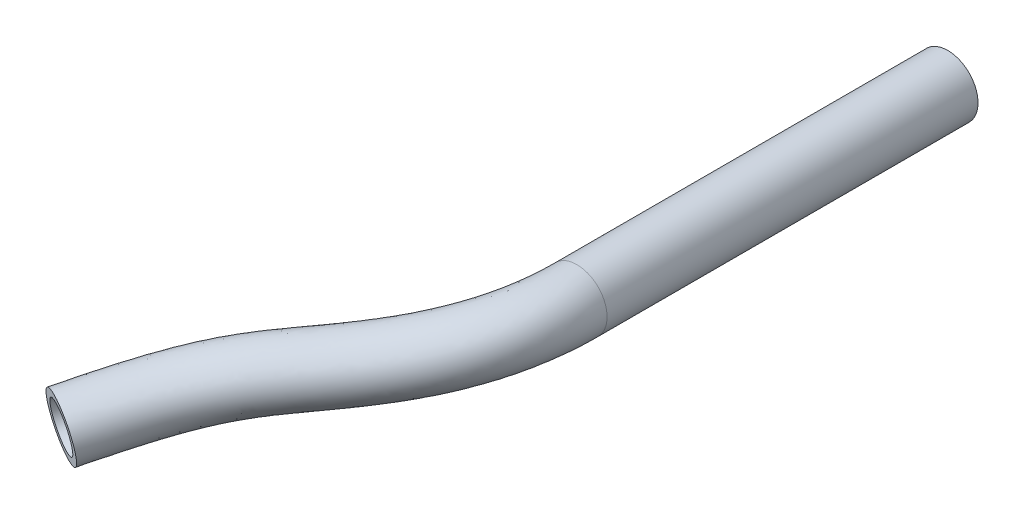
ISO-10303-21;
HEADER;
FILE_DESCRIPTION(('STEP AP214'),'2;1');
FILE_NAME('part.step','',(''),(''),'','','');
FILE_SCHEMA(('AUTOMOTIVE_DESIGN { 1 0 10303 214 1 1 1 1 }'));
ENDSEC;
DATA;
#1=APPLICATION_CONTEXT('core data for automotive mechanical design processes');
#2=APPLICATION_PROTOCOL_DEFINITION('international standard','automotive_design',2000,#1);
#3=PRODUCT_CONTEXT('',#1,'mechanical');
#4=PRODUCT('Part','Part','',(#3));
#5=PRODUCT_RELATED_PRODUCT_CATEGORY('part','',(#4));
#6=PRODUCT_DEFINITION_FORMATION('','',#4);
#7=PRODUCT_DEFINITION_CONTEXT('part definition',#1,'design');
#8=PRODUCT_DEFINITION('design','',#6,#7);
#9=PRODUCT_DEFINITION_SHAPE('','',#8);
#10=(LENGTH_UNIT() NAMED_UNIT(*) SI_UNIT(.MILLI.,.METRE.));
#11=(NAMED_UNIT(*) PLANE_ANGLE_UNIT() SI_UNIT($,.RADIAN.));
#12=(NAMED_UNIT(*) SI_UNIT($,.STERADIAN.) SOLID_ANGLE_UNIT());
#13=UNCERTAINTY_MEASURE_WITH_UNIT(LENGTH_MEASURE(1.E-05),#10,'distance_accuracy_value','');
#14=(GEOMETRIC_REPRESENTATION_CONTEXT(3) GLOBAL_UNCERTAINTY_ASSIGNED_CONTEXT((#13)) GLOBAL_UNIT_ASSIGNED_CONTEXT((#10,
#11,#12)) REPRESENTATION_CONTEXT('',''));
#15=CARTESIAN_POINT('',(0.,0.,0.));
#16=DIRECTION('',(0.,0.,1.));
#17=DIRECTION('',(1.,0.,0.));
#18=AXIS2_PLACEMENT_3D('',#15,#16,#17);
#19=CARTESIAN_POINT('',(0.,-13.4074772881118,3.23903712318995));
#20=DIRECTION('',(0.,0.,-1.));
#21=DIRECTION('',(0.,1.,0.));
#22=AXIS2_PLACEMENT_3D('',#19,#20,#21);
#23=CYLINDRICAL_SURFACE('',#22,1.5);
#24=CARTESIAN_POINT('',(0.,-13.4074772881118,3.23903712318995));
#25=DIRECTION('',(0.,0.,-1.));
#26=DIRECTION('',(-1.,0.,0.));
#27=AXIS2_PLACEMENT_3D('',#24,#25,#26);
#28=CIRCLE('',#27,1.5);
#29=CARTESIAN_POINT('',(0.,-11.9074772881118,3.23903712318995));
#30=VERTEX_POINT('',#29);
#31=EDGE_CURVE('E11',#30,#30,#28,.T.);
#32=CARTESIAN_POINT('',(0.,-13.4074772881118,-21.3340938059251));
#33=DIRECTION('',(0.,0.,-1.));
#34=DIRECTION('',(-1.,0.,0.));
#35=AXIS2_PLACEMENT_3D('',#32,#33,#34);
#36=CIRCLE('',#35,1.5);
#37=CARTESIAN_POINT('',(0.,-11.9074772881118,-21.3340938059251));
#38=VERTEX_POINT('',#37);
#39=EDGE_CURVE('E84',#38,#38,#36,.T.);
#40=CARTESIAN_POINT('',(0.,-11.9074772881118,3.23903712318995));
#41=CARTESIAN_POINT('',(0.,-11.9074772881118,2.983067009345));
#42=CARTESIAN_POINT('',(0.,-11.9074772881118,2.72709689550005));
#43=CARTESIAN_POINT('',(0.,-11.9074772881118,2.21515666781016));
#44=CARTESIAN_POINT('',(0.,-11.9074772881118,1.95918655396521));
#45=CARTESIAN_POINT('',(0.,-11.9074772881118,1.44724632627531));
#46=CARTESIAN_POINT('',(0.,-11.9074772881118,1.19127621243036));
#47=CARTESIAN_POINT('',(0.,-11.9074772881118,0.679335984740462));
#48=CARTESIAN_POINT('',(0.,-11.9074772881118,0.423365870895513));
#49=CARTESIAN_POINT('',(0.,-11.9074772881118,-0.0885743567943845));
#50=CARTESIAN_POINT('',(0.,-11.9074772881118,-0.344544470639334));
#51=CARTESIAN_POINT('',(0.,-11.9074772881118,-0.856484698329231));
#52=CARTESIAN_POINT('',(0.,-11.9074772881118,-1.11245481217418));
#53=CARTESIAN_POINT('',(0.,-11.9074772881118,-1.62439503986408));
#54=CARTESIAN_POINT('',(0.,-11.9074772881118,-1.88036515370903));
#55=CARTESIAN_POINT('',(0.,-11.9074772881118,-2.39230538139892));
#56=CARTESIAN_POINT('',(0.,-11.9074772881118,-2.64827549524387));
#57=CARTESIAN_POINT('',(0.,-11.9074772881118,-3.16021572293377));
#58=CARTESIAN_POINT('',(0.,-11.9074772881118,-3.41618583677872));
#59=CARTESIAN_POINT('',(0.,-11.9074772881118,-3.92812606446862));
#60=CARTESIAN_POINT('',(0.,-11.9074772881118,-4.18409617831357));
#61=CARTESIAN_POINT('',(0.,-11.9074772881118,-4.69603640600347));
#62=CARTESIAN_POINT('',(0.,-11.9074772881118,-4.95200651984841));
#63=CARTESIAN_POINT('',(0.,-11.9074772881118,-5.46394674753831));
#64=CARTESIAN_POINT('',(0.,-11.9074772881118,-5.71991686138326));
#65=CARTESIAN_POINT('',(0.,-11.9074772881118,-6.23185708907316));
#66=CARTESIAN_POINT('',(0.,-11.9074772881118,-6.48782720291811));
#67=CARTESIAN_POINT('',(0.,-11.9074772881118,-6.99976743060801));
#68=CARTESIAN_POINT('',(0.,-11.9074772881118,-7.25573754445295));
#69=CARTESIAN_POINT('',(0.,-11.9074772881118,-7.76767777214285));
#70=CARTESIAN_POINT('',(0.,-11.9074772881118,-8.0236478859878));
#71=CARTESIAN_POINT('',(0.,-11.9074772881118,-8.5355881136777));
#72=CARTESIAN_POINT('',(0.,-11.9074772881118,-8.79155822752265));
#73=CARTESIAN_POINT('',(0.,-11.9074772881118,-9.30349845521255));
#74=CARTESIAN_POINT('',(0.,-11.9074772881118,-9.5594685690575));
#75=CARTESIAN_POINT('',(0.,-11.9074772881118,-10.0714087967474));
#76=CARTESIAN_POINT('',(0.,-11.9074772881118,-10.3273789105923));
#77=CARTESIAN_POINT('',(0.,-11.9074772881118,-10.8393191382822));
#78=CARTESIAN_POINT('',(0.,-11.9074772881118,-11.0952892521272));
#79=CARTESIAN_POINT('',(0.,-11.9074772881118,-11.6072294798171));
#80=CARTESIAN_POINT('',(0.,-11.9074772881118,-11.863199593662));
#81=CARTESIAN_POINT('',(0.,-11.9074772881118,-12.3751398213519));
#82=CARTESIAN_POINT('',(0.,-11.9074772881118,-12.6311099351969));
#83=CARTESIAN_POINT('',(0.,-11.9074772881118,-13.1430501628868));
#84=CARTESIAN_POINT('',(0.,-11.9074772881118,-13.3990202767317));
#85=CARTESIAN_POINT('',(0.,-11.9074772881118,-13.9109605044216));
#86=CARTESIAN_POINT('',(0.,-11.9074772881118,-14.1669306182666));
#87=CARTESIAN_POINT('',(0.,-11.9074772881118,-14.6788708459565));
#88=CARTESIAN_POINT('',(0.,-11.9074772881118,-14.9348409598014));
#89=CARTESIAN_POINT('',(0.,-11.9074772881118,-15.4467811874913));
#90=CARTESIAN_POINT('',(0.,-11.9074772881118,-15.7027513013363));
#91=CARTESIAN_POINT('',(0.,-11.9074772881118,-16.2146915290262));
#92=CARTESIAN_POINT('',(0.,-11.9074772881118,-16.4706616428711));
#93=CARTESIAN_POINT('',(0.,-11.9074772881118,-16.982601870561));
#94=CARTESIAN_POINT('',(0.,-11.9074772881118,-17.238571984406));
#95=CARTESIAN_POINT('',(0.,-11.9074772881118,-17.7505122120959));
#96=CARTESIAN_POINT('',(0.,-11.9074772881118,-18.0064823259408));
#97=CARTESIAN_POINT('',(0.,-11.9074772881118,-18.5184225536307));
#98=CARTESIAN_POINT('',(0.,-11.9074772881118,-18.7743926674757));
#99=CARTESIAN_POINT('',(0.,-11.9074772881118,-19.2863328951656));
#100=CARTESIAN_POINT('',(0.,-11.9074772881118,-19.5423030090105));
#101=CARTESIAN_POINT('',(0.,-11.9074772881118,-20.0542432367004));
#102=CARTESIAN_POINT('',(0.,-11.9074772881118,-20.3102133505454));
#103=CARTESIAN_POINT('',(0.,-11.9074772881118,-20.8221535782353));
#104=CARTESIAN_POINT('',(0.,-11.9074772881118,-21.0781236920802));
#105=CARTESIAN_POINT('',(0.,-11.9074772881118,-21.3340938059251));
#106=B_SPLINE_CURVE_WITH_KNOTS('',3,(#40,#41,#42,#43,#44,#45,#46,#47,#48,#49,#50,#51,#52,#53,
#54,#55,#56,#57,#58,#59,#60,#61,#62,#63,#64,#65,#66,#67,#68,#69,#70,#71,#72,#73,#74,#75,#76,#77,
#78,#79,#80,#81,#82,#83,#84,#85,#86,#87,#88,#89,#90,#91,#92,#93,#94,#95,#96,#97,#98,#99,#100,
#101,#102,#103,#104,#105),.UNSPECIFIED.,.F.,.F.,(4,2,2,2,2,2,2,2,2,2,2,2,2,2,2,2,2,2,2,2,2,2,2,
2,2,2,2,2,2,2,2,2,4),(0.,0.767910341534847,1.53582068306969,2.30373102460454,3.07164136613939,
3.83955170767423,4.60746204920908,5.37537239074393,6.14328273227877,6.91119307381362,
7.67910341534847,8.44701375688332,9.21492409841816,9.98283443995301,10.7507447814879,
11.5186551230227,12.2865654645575,13.0544758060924,13.8223861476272,14.5902964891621,
15.3582068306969,16.1261171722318,16.8940275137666,17.6619378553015,18.4298481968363,
19.1977585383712,19.965668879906,20.7335792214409,21.5014895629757,22.2693999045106,
23.0373102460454,23.8052205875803,24.5731309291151),.UNSPECIFIED.);
#107=EDGE_CURVE('BSEAM73',#30,#38,#106,.T.);
#108=ORIENTED_EDGE('',*,*,#31,.F.);
#109=ORIENTED_EDGE('',*,*,#39,.T.);
#110=ORIENTED_EDGE('',*,*,#107,.T.);
#111=ORIENTED_EDGE('',*,*,#107,.F.);
#112=EDGE_LOOP('',(#108,#110,#109,#111));
#113=FACE_BOUND('',#112,.T.);
#114=ADVANCED_FACE('F73',(#113),#23,.F.);
#115=CARTESIAN_POINT('',(0.,-13.4074772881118,3.23903712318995));
#116=DIRECTION('',(0.,0.,-1.));
#117=DIRECTION('',(0.,1.,0.));
#118=AXIS2_PLACEMENT_3D('',#115,#116,#117);
#119=CYLINDRICAL_SURFACE('',#118,2.);
#120=CARTESIAN_POINT('',(0.,-13.4074772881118,3.23903712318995));
#121=DIRECTION('',(0.,0.,-1.));
#122=DIRECTION('',(-1.,0.,0.));
#123=AXIS2_PLACEMENT_3D('',#120,#121,#122);
#124=CIRCLE('',#123,2.);
#125=CARTESIAN_POINT('',(0.,-11.4074772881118,3.23903712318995));
#126=VERTEX_POINT('',#125);
#127=EDGE_CURVE('E89',#126,#126,#124,.T.);
#128=CARTESIAN_POINT('',(0.,-13.4074772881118,-21.3340938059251));
#129=DIRECTION('',(0.,0.,-1.));
#130=DIRECTION('',(-1.,0.,0.));
#131=AXIS2_PLACEMENT_3D('',#128,#129,#130);
#132=CIRCLE('',#131,2.);
#133=CARTESIAN_POINT('',(0.,-11.4074772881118,-21.3340938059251));
#134=VERTEX_POINT('',#133);
#135=EDGE_CURVE('E76',#134,#134,#132,.T.);
#136=CARTESIAN_POINT('',(0.,-11.4074772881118,3.23903712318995));
#137=CARTESIAN_POINT('',(0.,-11.4074772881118,2.983067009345));
#138=CARTESIAN_POINT('',(0.,-11.4074772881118,2.72709689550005));
#139=CARTESIAN_POINT('',(0.,-11.4074772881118,2.21515666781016));
#140=CARTESIAN_POINT('',(0.,-11.4074772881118,1.95918655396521));
#141=CARTESIAN_POINT('',(0.,-11.4074772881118,1.44724632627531));
#142=CARTESIAN_POINT('',(0.,-11.4074772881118,1.19127621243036));
#143=CARTESIAN_POINT('',(0.,-11.4074772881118,0.679335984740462));
#144=CARTESIAN_POINT('',(0.,-11.4074772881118,0.423365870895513));
#145=CARTESIAN_POINT('',(0.,-11.4074772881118,-0.0885743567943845));
#146=CARTESIAN_POINT('',(0.,-11.4074772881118,-0.344544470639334));
#147=CARTESIAN_POINT('',(0.,-11.4074772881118,-0.856484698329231));
#148=CARTESIAN_POINT('',(0.,-11.4074772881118,-1.11245481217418));
#149=CARTESIAN_POINT('',(0.,-11.4074772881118,-1.62439503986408));
#150=CARTESIAN_POINT('',(0.,-11.4074772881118,-1.88036515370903));
#151=CARTESIAN_POINT('',(0.,-11.4074772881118,-2.39230538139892));
#152=CARTESIAN_POINT('',(0.,-11.4074772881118,-2.64827549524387));
#153=CARTESIAN_POINT('',(0.,-11.4074772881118,-3.16021572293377));
#154=CARTESIAN_POINT('',(0.,-11.4074772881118,-3.41618583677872));
#155=CARTESIAN_POINT('',(0.,-11.4074772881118,-3.92812606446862));
#156=CARTESIAN_POINT('',(0.,-11.4074772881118,-4.18409617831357));
#157=CARTESIAN_POINT('',(0.,-11.4074772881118,-4.69603640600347));
#158=CARTESIAN_POINT('',(0.,-11.4074772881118,-4.95200651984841));
#159=CARTESIAN_POINT('',(0.,-11.4074772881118,-5.46394674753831));
#160=CARTESIAN_POINT('',(0.,-11.4074772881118,-5.71991686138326));
#161=CARTESIAN_POINT('',(0.,-11.4074772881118,-6.23185708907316));
#162=CARTESIAN_POINT('',(0.,-11.4074772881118,-6.48782720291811));
#163=CARTESIAN_POINT('',(0.,-11.4074772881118,-6.99976743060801));
#164=CARTESIAN_POINT('',(0.,-11.4074772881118,-7.25573754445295));
#165=CARTESIAN_POINT('',(0.,-11.4074772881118,-7.76767777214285));
#166=CARTESIAN_POINT('',(0.,-11.4074772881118,-8.0236478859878));
#167=CARTESIAN_POINT('',(0.,-11.4074772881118,-8.5355881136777));
#168=CARTESIAN_POINT('',(0.,-11.4074772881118,-8.79155822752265));
#169=CARTESIAN_POINT('',(0.,-11.4074772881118,-9.30349845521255));
#170=CARTESIAN_POINT('',(0.,-11.4074772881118,-9.5594685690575));
#171=CARTESIAN_POINT('',(0.,-11.4074772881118,-10.0714087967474));
#172=CARTESIAN_POINT('',(0.,-11.4074772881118,-10.3273789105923));
#173=CARTESIAN_POINT('',(0.,-11.4074772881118,-10.8393191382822));
#174=CARTESIAN_POINT('',(0.,-11.4074772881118,-11.0952892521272));
#175=CARTESIAN_POINT('',(0.,-11.4074772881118,-11.6072294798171));
#176=CARTESIAN_POINT('',(0.,-11.4074772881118,-11.863199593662));
#177=CARTESIAN_POINT('',(0.,-11.4074772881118,-12.3751398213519));
#178=CARTESIAN_POINT('',(0.,-11.4074772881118,-12.6311099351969));
#179=CARTESIAN_POINT('',(0.,-11.4074772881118,-13.1430501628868));
#180=CARTESIAN_POINT('',(0.,-11.4074772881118,-13.3990202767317));
#181=CARTESIAN_POINT('',(0.,-11.4074772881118,-13.9109605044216));
#182=CARTESIAN_POINT('',(0.,-11.4074772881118,-14.1669306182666));
#183=CARTESIAN_POINT('',(0.,-11.4074772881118,-14.6788708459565));
#184=CARTESIAN_POINT('',(0.,-11.4074772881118,-14.9348409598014));
#185=CARTESIAN_POINT('',(0.,-11.4074772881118,-15.4467811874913));
#186=CARTESIAN_POINT('',(0.,-11.4074772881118,-15.7027513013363));
#187=CARTESIAN_POINT('',(0.,-11.4074772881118,-16.2146915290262));
#188=CARTESIAN_POINT('',(0.,-11.4074772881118,-16.4706616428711));
#189=CARTESIAN_POINT('',(0.,-11.4074772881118,-16.982601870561));
#190=CARTESIAN_POINT('',(0.,-11.4074772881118,-17.238571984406));
#191=CARTESIAN_POINT('',(0.,-11.4074772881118,-17.7505122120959));
#192=CARTESIAN_POINT('',(0.,-11.4074772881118,-18.0064823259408));
#193=CARTESIAN_POINT('',(0.,-11.4074772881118,-18.5184225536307));
#194=CARTESIAN_POINT('',(0.,-11.4074772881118,-18.7743926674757));
#195=CARTESIAN_POINT('',(0.,-11.4074772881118,-19.2863328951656));
#196=CARTESIAN_POINT('',(0.,-11.4074772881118,-19.5423030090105));
#197=CARTESIAN_POINT('',(0.,-11.4074772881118,-20.0542432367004));
#198=CARTESIAN_POINT('',(0.,-11.4074772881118,-20.3102133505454));
#199=CARTESIAN_POINT('',(0.,-11.4074772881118,-20.8221535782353));
#200=CARTESIAN_POINT('',(0.,-11.4074772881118,-21.0781236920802));
#201=CARTESIAN_POINT('',(0.,-11.4074772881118,-21.3340938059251));
#202=B_SPLINE_CURVE_WITH_KNOTS('',3,(#136,#137,#138,#139,#140,#141,#142,#143,#144,#145,#146,
#147,#148,#149,#150,#151,#152,#153,#154,#155,#156,#157,#158,#159,#160,#161,#162,#163,#164,#165,
#166,#167,#168,#169,#170,#171,#172,#173,#174,#175,#176,#177,#178,#179,#180,#181,#182,#183,#184,
#185,#186,#187,#188,#189,#190,#191,#192,#193,#194,#195,#196,#197,#198,#199,#200,#201),
.UNSPECIFIED.,.F.,.F.,(4,2,2,2,2,2,2,2,2,2,2,2,2,2,2,2,2,2,2,2,2,2,2,2,2,2,2,2,2,2,2,2,4),(0.,
0.767910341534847,1.53582068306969,2.30373102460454,3.07164136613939,3.83955170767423,
4.60746204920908,5.37537239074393,6.14328273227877,6.91119307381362,7.67910341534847,
8.44701375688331,9.21492409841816,9.98283443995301,10.7507447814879,11.5186551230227,
12.2865654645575,13.0544758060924,13.8223861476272,14.5902964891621,15.3582068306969,
16.1261171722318,16.8940275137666,17.6619378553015,18.4298481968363,19.1977585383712,
19.965668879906,20.7335792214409,21.5014895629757,22.2693999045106,23.0373102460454,
23.8052205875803,24.5731309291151),.UNSPECIFIED.);
#203=EDGE_CURVE('BSEAM117',#126,#134,#202,.T.);
#204=ORIENTED_EDGE('',*,*,#127,.T.);
#205=ORIENTED_EDGE('',*,*,#135,.F.);
#206=ORIENTED_EDGE('',*,*,#203,.T.);
#207=ORIENTED_EDGE('',*,*,#203,.F.);
#208=EDGE_LOOP('',(#204,#206,#205,#207));
#209=FACE_BOUND('',#208,.T.);
#210=ADVANCED_FACE('F117',(#209),#119,.T.);
#211=CARTESIAN_POINT('',(0.,-13.4074772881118,-21.3340938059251));
#212=DIRECTION('',(0.,0.,-1.));
#213=DIRECTION('',(-1.,0.,0.));
#214=AXIS2_PLACEMENT_3D('',#211,#212,#213);
#215=PLANE('',#214);
#216=ORIENTED_EDGE('',*,*,#39,.F.);
#217=EDGE_LOOP('',(#216));
#218=FACE_BOUND('',#217,.T.);
#219=ORIENTED_EDGE('',*,*,#135,.T.);
#220=EDGE_LOOP('',(#219));
#221=FACE_BOUND('',#220,.T.);
#222=ADVANCED_FACE('F122',(#218,#221),#215,.T.);
#223=CARTESIAN_POINT('',(-16.5820748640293,-20.2456852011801,20.8132033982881));
#224=DIRECTION('',(0.441299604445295,0.181985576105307,-0.878712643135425));
#225=DIRECTION('',(-0.896341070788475,0.042747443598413,-0.441299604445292));
#226=AXIS2_PLACEMENT_3D('',#223,#224,#225);
#227=PLANE('',#226);
#228=CARTESIAN_POINT('',(-16.5820748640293,-20.2456852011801,20.8132033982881));
#229=DIRECTION('',(0.441299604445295,0.181985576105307,-0.878712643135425));
#230=DIRECTION('',(-0.896341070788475,0.042747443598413,-0.441299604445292));
#231=AXIS2_PLACEMENT_3D('',#228,#229,#230);
#232=CIRCLE('',#231,1.5);
#233=CARTESIAN_POINT('',(-17.926586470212,-20.1815640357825,20.1512539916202));
#234=VERTEX_POINT('',#233);
#235=EDGE_CURVE('E97',#234,#234,#232,.T.);
#236=ORIENTED_EDGE('',*,*,#235,.T.);
#237=EDGE_LOOP('',(#236));
#238=FACE_BOUND('',#237,.T.);
#239=CARTESIAN_POINT('',(-16.5820748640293,-20.2456852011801,20.8132033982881));
#240=DIRECTION('',(0.441299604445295,0.181985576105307,-0.878712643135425));
#241=DIRECTION('',(-0.896341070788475,0.042747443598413,-0.441299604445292));
#242=AXIS2_PLACEMENT_3D('',#239,#240,#241);
#243=CIRCLE('',#242,2.);
#244=CARTESIAN_POINT('',(-18.3747570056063,-20.1601903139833,19.9306041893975));
#245=VERTEX_POINT('',#244);
#246=EDGE_CURVE('E86',#245,#245,#243,.T.);
#247=ORIENTED_EDGE('',*,*,#246,.F.);
#248=EDGE_LOOP('',(#247));
#249=FACE_BOUND('',#248,.T.);
#250=ADVANCED_FACE('F101',(#238,#249),#227,.F.);
#251=CARTESIAN_POINT('',(-2.,-13.4074772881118,3.23903712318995));
#252=CARTESIAN_POINT('',(-1.99777758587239,-13.4065607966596,3.88939531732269));
#253=CARTESIAN_POINT('',(-2.08495535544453,-13.4425116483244,4.68277189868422));
#254=CARTESIAN_POINT('',(-2.42323183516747,-13.5820119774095,5.9199205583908));
#255=CARTESIAN_POINT('',(-2.93202442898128,-13.7918306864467,6.88450417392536));
#256=CARTESIAN_POINT('',(-3.60254837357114,-14.0683450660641,7.74480923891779));
#257=CARTESIAN_POINT('',(-4.83549142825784,-14.5767929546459,8.87497938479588));
#258=CARTESIAN_POINT('',(-6.5631333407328,-15.2892474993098,9.84791785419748));
#259=CARTESIAN_POINT('',(-8.35655553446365,-16.028828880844,10.5935749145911));
#260=CARTESIAN_POINT('',(-9.86167932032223,-16.6495201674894,11.1933071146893));
#261=CARTESIAN_POINT('',(-11.4249770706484,-17.2942015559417,11.8383091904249));
#262=CARTESIAN_POINT('',(-13.2534682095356,-18.0482448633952,12.8824099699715));
#263=CARTESIAN_POINT('',(-15.002693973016,-18.769600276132,14.4673752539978));
#264=CARTESIAN_POINT('',(-16.6358741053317,-19.4431001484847,16.6669708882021));
#265=CARTESIAN_POINT('',(-17.7968450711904,-19.9218677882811,18.7696598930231));
#266=CARTESIAN_POINT('',(-18.3747570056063,-20.1601903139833,19.9306041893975));
#267=CARTESIAN_POINT('',(-2.,-17.4074772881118,3.23903712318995));
#268=CARTESIAN_POINT('',(-1.99653572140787,-17.4060486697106,4.25280946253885));
#269=CARTESIAN_POINT('',(-2.06913626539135,-17.4359880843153,4.17379525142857));
#270=CARTESIAN_POINT('',(-2.3170581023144,-17.538227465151,5.36645587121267));
#271=CARTESIAN_POINT('',(-2.68058992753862,-17.6881427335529,5.98290002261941));
#272=CARTESIAN_POINT('',(-3.18224013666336,-17.8950160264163,6.65277796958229));
#273=CARTESIAN_POINT('',(-4.1737381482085,-18.3038954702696,7.56203828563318));
#274=CARTESIAN_POINT('',(-5.71031105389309,-18.9375559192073,8.44599815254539));
#275=CARTESIAN_POINT('',(-7.43167259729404,-19.6474205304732,9.1613261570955));
#276=CARTESIAN_POINT('',(-8.93337669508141,-20.2667015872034,9.76024048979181));
#277=CARTESIAN_POINT('',(-10.5697963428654,-20.9415373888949,10.4335756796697));
#278=CARTESIAN_POINT('',(-12.6257886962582,-21.7893989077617,11.5944175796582));
#279=CARTESIAN_POINT('',(-14.6344082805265,-22.6177245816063,13.4345567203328));
#280=CARTESIAN_POINT('',(-16.3513519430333,-23.3257673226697,15.7176255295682));
#281=CARTESIAN_POINT('',(-17.7113007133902,-23.8865905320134,18.2133654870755));
#282=CARTESIAN_POINT('',(-18.2037672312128,-24.0896766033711,19.2026618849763));
#283=CARTESIAN_POINT('',(2.,-17.4074772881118,3.23903712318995));
#284=CARTESIAN_POINT('',(2.00346427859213,-17.4060486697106,4.25280946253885));
#285=CARTESIAN_POINT('',(1.89110625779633,-17.4523834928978,4.99903650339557));
#286=CARTESIAN_POINT('',(1.42585379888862,-17.6442468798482,6.8181320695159));
#287=CARTESIAN_POINT('',(0.709603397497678,-17.9396181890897,8.13991282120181));
#288=CARTESIAN_POINT('',(-0.201428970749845,-18.315314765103,9.30849360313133));
#289=CARTESIAN_POINT('',(-1.77843453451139,-18.9656490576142,10.7401504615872));
#290=CARTESIAN_POINT('',(-3.77848495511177,-19.790440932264,11.8465731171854));
#291=CARTESIAN_POINT('',(-5.67415664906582,-20.5721885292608,12.6344896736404));
#292=CARTESIAN_POINT('',(-7.18436179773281,-21.1949752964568,13.2348575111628));
#293=CARTESIAN_POINT('',(-8.6453722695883,-21.7974748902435,13.8437256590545));
#294=CARTESIAN_POINT('',(-10.1409582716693,-22.4142329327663,14.703800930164));
#295=CARTESIAN_POINT('',(-11.5532350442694,-22.9966354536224,15.9908202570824));
#296=CARTESIAN_POINT('',(-12.9451335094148,-23.570634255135,17.8265323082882));
#297=CARTESIAN_POINT('',(-14.1259364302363,-24.057580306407,19.9785639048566));
#298=CARTESIAN_POINT('',(-14.6184029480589,-24.2606663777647,20.9678603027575));
#299=CARTESIAN_POINT('',(2.,-13.4074772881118,3.23903712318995));
#300=CARTESIAN_POINT('',(2.00284334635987,-13.4063047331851,4.07110238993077));
#301=CARTESIAN_POINT('',(1.87499900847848,-13.4590258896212,5.42368360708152));
#302=CARTESIAN_POINT('',(1.3197572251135,-13.6879995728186,7.39418955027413));
#303=CARTESIAN_POINT('',(0.458148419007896,-14.0433145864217,9.03547534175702));
#304=CARTESIAN_POINT('',(-0.621732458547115,-14.4886418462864,10.4020986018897));
#305=CARTESIAN_POINT('',(-2.44018796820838,-15.2385466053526,12.0519247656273));
#306=CARTESIAN_POINT('',(-4.63133860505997,-16.142145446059,13.2487069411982));
#307=CARTESIAN_POINT('',(-6.59898211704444,-16.9535731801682,14.0667552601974));
#308=CARTESIAN_POINT('',(-8.11264996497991,-17.5777879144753,14.6678317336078));
#309=CARTESIAN_POINT('',(-9.50093138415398,-18.1502950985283,15.2492406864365));
#310=CARTESIAN_POINT('',(-10.7672150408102,-18.6724921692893,15.9889294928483));
#311=CARTESIAN_POINT('',(-11.9268333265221,-19.1507019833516,17.0343125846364));
#312=CARTESIAN_POINT('',(-13.2098280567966,-19.6797904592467,18.7360463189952));
#313=CARTESIAN_POINT('',(-14.2542034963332,-20.110475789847,20.6206822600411));
#314=CARTESIAN_POINT('',(-14.7893927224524,-20.3311800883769,21.6958026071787));
#315=CARTESIAN_POINT('',(2.,-9.40747728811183,3.23903712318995));
#316=CARTESIAN_POINT('',(2.00222241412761,-9.40656079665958,3.8893953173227));
#317=CARTESIAN_POINT('',(1.85889175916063,-9.46566828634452,5.84833071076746));
#318=CARTESIAN_POINT('',(1.21366065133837,-9.73175226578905,7.97024703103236));
#319=CARTESIAN_POINT('',(0.206693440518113,-10.1470109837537,9.93103786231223));
#320=CARTESIAN_POINT('',(-1.04203594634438,-10.6619689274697,11.4957036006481));
#321=CARTESIAN_POINT('',(-3.10194140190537,-11.5114441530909,13.3636990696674));
#322=CARTESIAN_POINT('',(-5.48419225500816,-12.4938499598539,14.650840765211));
#323=CARTESIAN_POINT('',(-7.52380758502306,-13.3349578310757,15.4990208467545));
#324=CARTESIAN_POINT('',(-9.04093813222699,-13.9606005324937,16.1008059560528));
#325=CARTESIAN_POINT('',(-10.3564904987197,-14.5031153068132,16.6547557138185));
#326=CARTESIAN_POINT('',(-11.3934718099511,-14.9307514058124,17.2740580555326));
#327=CARTESIAN_POINT('',(-12.3004316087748,-15.3047685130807,18.0778049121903));
#328=CARTESIAN_POINT('',(-13.4745226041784,-15.7889466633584,19.6455603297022));
#329=CARTESIAN_POINT('',(-14.38247056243,-16.1633712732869,21.2628006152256));
#330=CARTESIAN_POINT('',(-14.9603824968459,-16.4016937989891,22.4237449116));
#331=CARTESIAN_POINT('',(-2.,-9.40747728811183,3.23903712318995));
#332=CARTESIAN_POINT('',(-1.99901945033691,-9.40707292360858,3.52598117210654));
#333=CARTESIAN_POINT('',(-2.10077444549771,-9.44903521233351,5.19174854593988));
#334=CARTESIAN_POINT('',(-2.52940556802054,-9.62579648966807,6.47338524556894));
#335=CARTESIAN_POINT('',(-3.18345893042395,-9.89551863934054,7.78610832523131));
#336=CARTESIAN_POINT('',(-4.02285661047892,-10.2416741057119,8.83684050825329));
#337=CARTESIAN_POINT('',(-5.4972447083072,-10.8496904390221,10.1879204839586));
#338=CARTESIAN_POINT('',(-7.4159556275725,-11.6409390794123,11.2498375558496));
#339=CARTESIAN_POINT('',(-9.28143847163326,-12.4102372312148,12.0258236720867));
#340=CARTESIAN_POINT('',(-10.789981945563,-13.0323387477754,12.6263737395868));
#341=CARTESIAN_POINT('',(-12.2801577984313,-13.6468657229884,13.2430427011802));
#342=CARTESIAN_POINT('',(-13.881147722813,-14.3070908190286,14.1704023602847));
#343=CARTESIAN_POINT('',(-15.3709796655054,-14.9214759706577,15.5001937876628));
#344=CARTESIAN_POINT('',(-16.9203962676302,-15.5604329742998,17.6163162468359));
#345=CARTESIAN_POINT('',(-17.8823894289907,-15.9571450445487,19.3259542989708));
#346=CARTESIAN_POINT('',(-18.5457467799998,-16.2307040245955,20.6585464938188));
#347=CARTESIAN_POINT('',(-2.,-13.4074772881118,3.23903712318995));
#348=CARTESIAN_POINT('',(-1.99777758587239,-13.4065607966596,3.88939531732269));
#349=CARTESIAN_POINT('',(-2.08495535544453,-13.4425116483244,4.68277189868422));
#350=CARTESIAN_POINT('',(-2.42323183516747,-13.5820119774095,5.9199205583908));
#351=CARTESIAN_POINT('',(-2.93202442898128,-13.7918306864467,6.88450417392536));
#352=CARTESIAN_POINT('',(-3.60254837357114,-14.0683450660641,7.74480923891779));
#353=CARTESIAN_POINT('',(-4.83549142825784,-14.5767929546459,8.87497938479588));
#354=CARTESIAN_POINT('',(-6.5631333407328,-15.2892474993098,9.84791785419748));
#355=CARTESIAN_POINT('',(-8.35655553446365,-16.028828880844,10.5935749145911));
#356=CARTESIAN_POINT('',(-9.86167932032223,-16.6495201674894,11.1933071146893));
#357=CARTESIAN_POINT('',(-11.4249770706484,-17.2942015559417,11.8383091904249));
#358=CARTESIAN_POINT('',(-13.2534682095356,-18.0482448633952,12.8824099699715));
#359=CARTESIAN_POINT('',(-15.002693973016,-18.769600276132,14.4673752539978));
#360=CARTESIAN_POINT('',(-16.6358741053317,-19.4431001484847,16.6669708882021));
#361=CARTESIAN_POINT('',(-17.7968450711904,-19.9218677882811,18.7696598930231));
#362=CARTESIAN_POINT('',(-18.3747570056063,-20.1601903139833,19.9306041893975));
#363=(BOUNDED_SURFACE() B_SPLINE_SURFACE(3,3,((#251,#252,#253,#254,#255,#256,#257,#258,#259,
#260,#261,#262,#263,#264,#265,#266),(#267,#268,#269,#270,#271,#272,#273,#274,#275,#276,#277,
#278,#279,#280,#281,#282),(#283,#284,#285,#286,#287,#288,#289,#290,#291,#292,#293,#294,#295,
#296,#297,#298),(#299,#300,#301,#302,#303,#304,#305,#306,#307,#308,#309,#310,#311,#312,#313,
#314),(#315,#316,#317,#318,#319,#320,#321,#322,#323,#324,#325,#326,#327,#328,#329,#330),(#331,
#332,#333,#334,#335,#336,#337,#338,#339,#340,#341,#342,#343,#344,#345,#346),(#347,#348,#349,
#350,#351,#352,#353,#354,#355,#356,#357,#358,#359,#360,#361,#362)),.UNSPECIFIED.,.T.,.F.,
.F.) B_SPLINE_SURFACE_WITH_KNOTS((4,3,4),(4,1,1,1,1,1,1,1,1,1,1,1,1,4),(0.,0.5,1.),(0.,
0.0499999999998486,0.1,0.15,0.2,0.25,0.375,0.448815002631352,0.5,0.59999999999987,0.7,
0.800000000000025,0.900000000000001,1.),
.UNSPECIFIED.) GEOMETRIC_REPRESENTATION_ITEM() RATIONAL_B_SPLINE_SURFACE(((1.,1.,1.,1.,1.,1.,1.,
1.,1.,1.,1.,1.,1.,1.,1.,1.),(0.333333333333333,0.333333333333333,0.333333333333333,
0.333333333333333,0.333333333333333,0.333333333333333,0.333333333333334,0.333333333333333,
0.333333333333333,0.333333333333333,0.333333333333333,0.333333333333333,0.333333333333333,
0.333333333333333,0.333333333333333,0.333333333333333),(0.333333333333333,0.333333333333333,
0.333333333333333,0.333333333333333,0.333333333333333,0.333333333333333,0.333333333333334,
0.333333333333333,0.333333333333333,0.333333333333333,0.333333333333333,0.333333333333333,
0.333333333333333,0.333333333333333,0.333333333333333,0.333333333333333),(1.,1.,1.,1.,1.,1.,1.,
1.,1.,1.,1.,1.,1.,1.,1.,1.),(0.333333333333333,0.333333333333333,0.333333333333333,
0.333333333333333,0.333333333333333,0.333333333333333,0.333333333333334,0.333333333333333,
0.333333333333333,0.333333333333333,0.333333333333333,0.333333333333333,0.333333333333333,
0.333333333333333,0.333333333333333,0.333333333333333),(0.333333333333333,0.333333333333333,
0.333333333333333,0.333333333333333,0.333333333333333,0.333333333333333,0.333333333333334,
0.333333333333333,0.333333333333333,0.333333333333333,0.333333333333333,0.333333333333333,
0.333333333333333,0.333333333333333,0.333333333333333,0.333333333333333),(1.,1.,1.,1.,1.,1.,1.,
1.,1.,1.,1.,1.,1.,1.,1.,1.))) REPRESENTATION_ITEM('') SURFACE());
#364=ORIENTED_EDGE('',*,*,#127,.F.);
#365=EDGE_LOOP('',(#364));
#366=FACE_BOUND('',#365,.T.);
#367=ORIENTED_EDGE('',*,*,#246,.T.);
#368=EDGE_LOOP('',(#367));
#369=FACE_BOUND('',#368,.T.);
#370=ADVANCED_FACE('F106',(#366,#369),#363,.T.);
#371=CARTESIAN_POINT('',(-1.5,-13.4074772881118,3.23903712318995));
#372=CARTESIAN_POINT('',(-1.49777758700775,-13.4065607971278,3.88939498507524));
#373=CARTESIAN_POINT('',(-1.58992503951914,-13.4445610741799,4.78592720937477));
#374=CARTESIAN_POINT('',(-1.9553678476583,-13.5952644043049,6.10138004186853));
#375=CARTESIAN_POINT('',(-2.50825026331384,-13.8232651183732,7.15413078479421));
#376=CARTESIAN_POINT('',(-3.22994697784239,-14.1208824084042,8.07677369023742));
#377=CARTESIAN_POINT('',(-4.53607847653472,-14.6595121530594,9.27224340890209));
#378=CARTESIAN_POINT('',(-6.32165507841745,-15.3958581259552,10.2729897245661));
#379=CARTESIAN_POINT('',(-8.13686604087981,-16.1444248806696,11.0277203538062));
#380=CARTESIAN_POINT('',(-9.64305245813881,-16.76555438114,11.6276342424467));
#381=CARTESIAN_POINT('',(-11.1844240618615,-17.4011937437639,12.2645779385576));
#382=CARTESIAN_POINT('',(-12.9428644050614,-18.1263491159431,13.2710828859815));
#383=CARTESIAN_POINT('',(-14.6175473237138,-18.8169641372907,14.7869082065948));
#384=CARTESIAN_POINT('',(-16.2100967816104,-19.4737085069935,16.9305841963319));
#385=CARTESIAN_POINT('',(-17.3486745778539,-19.9432415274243,18.9903097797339));
#386=CARTESIAN_POINT('',(-17.926586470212,-20.1815640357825,20.1512539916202));
#387=CARTESIAN_POINT('',(-1.5,-16.4074772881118,3.23903712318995));
#388=CARTESIAN_POINT('',(-1.49684618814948,-16.4061767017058,4.16195574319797));
#389=CARTESIAN_POINT('',(-1.57806072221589,-16.4396684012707,4.40419465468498));
#390=CARTESIAN_POINT('',(-1.87573754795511,-16.5624260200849,5.68628154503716));
#391=CARTESIAN_POINT('',(-2.31967438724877,-16.7454991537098,6.47792766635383));
#392=CARTESIAN_POINT('',(-2.91471580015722,-16.9908856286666,7.2577502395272));
#393=CARTESIAN_POINT('',(-4.03976351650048,-17.4548390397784,8.28753758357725));
#394=CARTESIAN_POINT('',(-5.68203836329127,-18.1320894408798,9.22154994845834));
#395=CARTESIAN_POINT('',(-7.44320383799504,-18.8583686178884,9.95353378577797));
#396=CARTESIAN_POINT('',(-8.94682548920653,-19.4784404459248,10.5528342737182));
#397=CARTESIAN_POINT('',(-10.5430385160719,-20.1366956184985,11.2110278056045));
#398=CARTESIAN_POINT('',(-12.4721047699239,-20.9322146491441,12.3050885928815));
#399=CARTESIAN_POINT('',(-14.3413330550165,-21.7030573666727,14.0122943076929));
#400=CARTESIAN_POINT('',(-15.9967051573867,-22.3857088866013,16.2185751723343));
#401=CARTESIAN_POINT('',(-17.2845163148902,-22.9167835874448,18.5730889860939));
#402=CARTESIAN_POINT('',(-17.7983441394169,-23.1286787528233,19.6052972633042));
#403=CARTESIAN_POINT('',(1.5,-16.4074772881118,3.23903712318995));
#404=CARTESIAN_POINT('',(1.50315381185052,-16.4061767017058,4.16195574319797));
#405=CARTESIAN_POINT('',(1.39212117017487,-16.4519649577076,5.02312559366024));
#406=CARTESIAN_POINT('',(0.931446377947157,-16.6419405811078,6.77503869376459));
#407=CARTESIAN_POINT('',(0.222970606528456,-16.9341057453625,8.09568726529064));
#408=CARTESIAN_POINT('',(-0.679107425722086,-17.3061096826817,9.24953696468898));
#409=CARTESIAN_POINT('',(-2.24328580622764,-17.9511542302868,10.6711217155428));
#410=CARTESIAN_POINT('',(-4.23316878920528,-18.7717532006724,11.7719811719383));
#411=CARTESIAN_POINT('',(-6.12506687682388,-19.5519446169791,12.5584064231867));
#412=CARTESIAN_POINT('',(-7.63506431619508,-20.1746457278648,13.1587970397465));
#413=CARTESIAN_POINT('',(-9.09972046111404,-20.77864874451,13.7686402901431));
#414=CARTESIAN_POINT('',(-10.6084819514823,-21.4008401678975,14.6371261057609));
#415=CARTESIAN_POINT('',(-12.0304531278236,-21.9872405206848,15.9294919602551));
#416=CARTESIAN_POINT('',(-13.4420413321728,-22.5693590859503,17.8002552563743));
#417=CARTESIAN_POINT('',(-14.5954931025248,-23.04502591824,19.8969877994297));
#418=CARTESIAN_POINT('',(-15.1093209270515,-23.2569210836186,20.9291960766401));
#419=CARTESIAN_POINT('',(1.5,-13.4074772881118,3.23903712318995));
#420=CARTESIAN_POINT('',(1.50268811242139,-13.4063687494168,4.02567536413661));
#421=CARTESIAN_POINT('',(1.3800407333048,-13.4569467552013,5.34161095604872));
#422=CARTESIAN_POINT('',(0.851873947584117,-13.6747551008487,7.20708179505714));
#423=CARTESIAN_POINT('',(0.0343793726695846,-14.0118780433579,8.7673591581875));
#424=CARTESIAN_POINT('',(-0.994335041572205,-14.43610499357,10.0697407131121));
#425=CARTESIAN_POINT('',(-2.739600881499,-15.15582739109,11.6549524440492));
#426=CARTESIAN_POINT('',(-4.87280902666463,-16.0355315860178,12.8235815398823));
#427=CARTESIAN_POINT('',(-6.81868597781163,-16.8379831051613,13.6326056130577));
#428=CARTESIAN_POINT('',(-8.33128044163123,-17.461755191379,14.2335277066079));
#429=CARTESIAN_POINT('',(-9.74138979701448,-18.0432639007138,14.8227765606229));
#430=CARTESIAN_POINT('',(-11.0781745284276,-18.5945345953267,15.6009725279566));
#431=CARTESIAN_POINT('',(-12.3106518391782,-19.1027904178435,16.7121112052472));
#432=CARTESIAN_POINT('',(-13.6405622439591,-19.6512262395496,18.4823907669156));
#433=CARTESIAN_POINT('',(-14.6916933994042,-20.0846975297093,20.3785765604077));
#434=CARTESIAN_POINT('',(-15.2375632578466,-20.3098063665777,21.4751528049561));
#435=CARTESIAN_POINT('',(1.5,-10.4074772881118,3.23903712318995));
#436=CARTESIAN_POINT('',(1.50222241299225,-10.4065607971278,3.88939498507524));
#437=CARTESIAN_POINT('',(1.36796029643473,-10.461928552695,5.6600963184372));
#438=CARTESIAN_POINT('',(0.772301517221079,-10.7075696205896,7.6391248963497));
#439=CARTESIAN_POINT('',(-0.154211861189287,-11.0896503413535,9.43903105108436));
#440=CARTESIAN_POINT('',(-1.30956265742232,-11.5661003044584,10.8899444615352));
#441=CARTESIAN_POINT('',(-3.23591595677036,-12.3605005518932,12.6387831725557));
#442=CARTESIAN_POINT('',(-5.51244926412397,-13.2993099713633,13.8751819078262));
#443=CARTESIAN_POINT('',(-7.51230507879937,-14.1240215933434,14.7068048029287));
#444=CARTESIAN_POINT('',(-9.02749656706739,-14.7488646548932,15.3082583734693));
#445=CARTESIAN_POINT('',(-10.3830591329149,-15.3078790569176,15.8769128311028));
#446=CARTESIAN_POINT('',(-11.547867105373,-15.788229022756,16.5648189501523));
#447=CARTESIAN_POINT('',(-12.5908505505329,-16.2183403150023,17.4947304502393));
#448=CARTESIAN_POINT('',(-13.8390831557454,-16.7330933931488,19.164526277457));
#449=CARTESIAN_POINT('',(-14.7878936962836,-17.1243691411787,20.8601653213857));
#450=CARTESIAN_POINT('',(-15.3658055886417,-17.3626916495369,22.021109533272));
#451=CARTESIAN_POINT('',(-1.5,-10.4074772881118,3.23903712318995));
#452=CARTESIAN_POINT('',(-1.49870898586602,-10.4069448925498,3.61683422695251));
#453=CARTESIAN_POINT('',(-1.60178935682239,-10.4494537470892,5.16765976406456));
#454=CARTESIAN_POINT('',(-2.0349981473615,-10.628102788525,6.51647853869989));
#455=CARTESIAN_POINT('',(-2.6968261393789,-10.9010310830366,7.83033390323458));
#456=CARTESIAN_POINT('',(-3.54517815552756,-11.2508791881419,8.89579714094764));
#457=CARTESIAN_POINT('',(-5.03239343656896,-11.8641852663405,10.2569492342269));
#458=CARTESIAN_POINT('',(-6.96127179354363,-12.6596268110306,11.3244295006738));
#459=CARTESIAN_POINT('',(-8.83052824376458,-13.4304811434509,12.1019069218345));
#460=CARTESIAN_POINT('',(-10.3392794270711,-14.0526683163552,12.7024342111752));
#461=CARTESIAN_POINT('',(-11.825809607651,-14.6656918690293,13.3181280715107));
#462=CARTESIAN_POINT('',(-13.4136240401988,-15.3204835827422,14.2370771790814));
#463=CARTESIAN_POINT('',(-14.893761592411,-15.9308709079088,15.5615221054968));
#464=CARTESIAN_POINT('',(-16.4234884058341,-16.5617081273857,17.6425932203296));
#465=CARTESIAN_POINT('',(-17.4128328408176,-16.9696994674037,19.4075305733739));
#466=CARTESIAN_POINT('',(-18.0548288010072,-17.2344493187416,20.6972107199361));
#467=CARTESIAN_POINT('',(-1.5,-13.4074772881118,3.23903712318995));
#468=CARTESIAN_POINT('',(-1.49777758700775,-13.4065607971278,3.88939498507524));
#469=CARTESIAN_POINT('',(-1.58992503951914,-13.4445610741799,4.78592720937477));
#470=CARTESIAN_POINT('',(-1.9553678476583,-13.5952644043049,6.10138004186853));
#471=CARTESIAN_POINT('',(-2.50825026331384,-13.8232651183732,7.15413078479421));
#472=CARTESIAN_POINT('',(-3.22994697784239,-14.1208824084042,8.07677369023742));
#473=CARTESIAN_POINT('',(-4.53607847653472,-14.6595121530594,9.27224340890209));
#474=CARTESIAN_POINT('',(-6.32165507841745,-15.3958581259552,10.2729897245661));
#475=CARTESIAN_POINT('',(-8.13686604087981,-16.1444248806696,11.0277203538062));
#476=CARTESIAN_POINT('',(-9.64305245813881,-16.76555438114,11.6276342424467));
#477=CARTESIAN_POINT('',(-11.1844240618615,-17.4011937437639,12.2645779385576));
#478=CARTESIAN_POINT('',(-12.9428644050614,-18.1263491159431,13.2710828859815));
#479=CARTESIAN_POINT('',(-14.6175473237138,-18.8169641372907,14.7869082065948));
#480=CARTESIAN_POINT('',(-16.2100967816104,-19.4737085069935,16.9305841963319));
#481=CARTESIAN_POINT('',(-17.3486745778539,-19.9432415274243,18.9903097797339));
#482=CARTESIAN_POINT('',(-17.926586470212,-20.1815640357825,20.1512539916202));
#483=(BOUNDED_SURFACE() B_SPLINE_SURFACE(3,3,((#371,#372,#373,#374,#375,#376,#377,#378,#379,
#380,#381,#382,#383,#384,#385,#386),(#387,#388,#389,#390,#391,#392,#393,#394,#395,#396,#397,
#398,#399,#400,#401,#402),(#403,#404,#405,#406,#407,#408,#409,#410,#411,#412,#413,#414,#415,
#416,#417,#418),(#419,#420,#421,#422,#423,#424,#425,#426,#427,#428,#429,#430,#431,#432,#433,
#434),(#435,#436,#437,#438,#439,#440,#441,#442,#443,#444,#445,#446,#447,#448,#449,#450),(#451,
#452,#453,#454,#455,#456,#457,#458,#459,#460,#461,#462,#463,#464,#465,#466),(#467,#468,#469,
#470,#471,#472,#473,#474,#475,#476,#477,#478,#479,#480,#481,#482)),.UNSPECIFIED.,.T.,.F.,
.F.) B_SPLINE_SURFACE_WITH_KNOTS((4,3,4),(4,1,1,1,1,1,1,1,1,1,1,1,1,4),(0.,0.5,1.),(0.,
0.0499999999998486,0.1,0.15,0.2,0.25,0.375,0.448815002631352,0.5,0.59999999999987,0.7,
0.800000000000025,0.900000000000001,1.),
.UNSPECIFIED.) GEOMETRIC_REPRESENTATION_ITEM() RATIONAL_B_SPLINE_SURFACE(((1.,1.,1.,1.,1.,1.,1.,
1.,1.,1.,1.,1.,1.,1.,1.,1.),(0.333333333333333,0.333333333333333,0.333333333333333,
0.333333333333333,0.333333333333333,0.333333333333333,0.333333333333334,0.333333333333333,
0.333333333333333,0.333333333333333,0.333333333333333,0.333333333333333,0.333333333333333,
0.333333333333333,0.333333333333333,0.333333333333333),(0.333333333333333,0.333333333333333,
0.333333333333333,0.333333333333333,0.333333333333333,0.333333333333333,0.333333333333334,
0.333333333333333,0.333333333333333,0.333333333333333,0.333333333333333,0.333333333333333,
0.333333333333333,0.333333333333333,0.333333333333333,0.333333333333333),(1.,1.,1.,1.,1.,1.,1.,
1.,1.,1.,1.,1.,1.,1.,1.,1.),(0.333333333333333,0.333333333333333,0.333333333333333,
0.333333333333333,0.333333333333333,0.333333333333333,0.333333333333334,0.333333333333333,
0.333333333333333,0.333333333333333,0.333333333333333,0.333333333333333,0.333333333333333,
0.333333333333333,0.333333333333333,0.333333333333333),(0.333333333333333,0.333333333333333,
0.333333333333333,0.333333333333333,0.333333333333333,0.333333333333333,0.333333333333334,
0.333333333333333,0.333333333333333,0.333333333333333,0.333333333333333,0.333333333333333,
0.333333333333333,0.333333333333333,0.333333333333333,0.333333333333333),(1.,1.,1.,1.,1.,1.,1.,
1.,1.,1.,1.,1.,1.,1.,1.,1.))) REPRESENTATION_ITEM('') SURFACE());
#484=ORIENTED_EDGE('',*,*,#31,.T.);
#485=EDGE_LOOP('',(#484));
#486=FACE_BOUND('',#485,.T.);
#487=ORIENTED_EDGE('',*,*,#235,.F.);
#488=EDGE_LOOP('',(#487));
#489=FACE_BOUND('',#488,.T.);
#490=ADVANCED_FACE('F104',(#486,#489),#483,.F.);
#491=CLOSED_SHELL('',(#114,#210,#222,#250,#370,#490));
#492=MANIFOLD_SOLID_BREP('B2',#491);
#493=ADVANCED_BREP_SHAPE_REPRESENTATION('',(#18,#492),#14);
#494=SHAPE_DEFINITION_REPRESENTATION(#9,#493);
ENDSEC;
END-ISO-10303-21;
